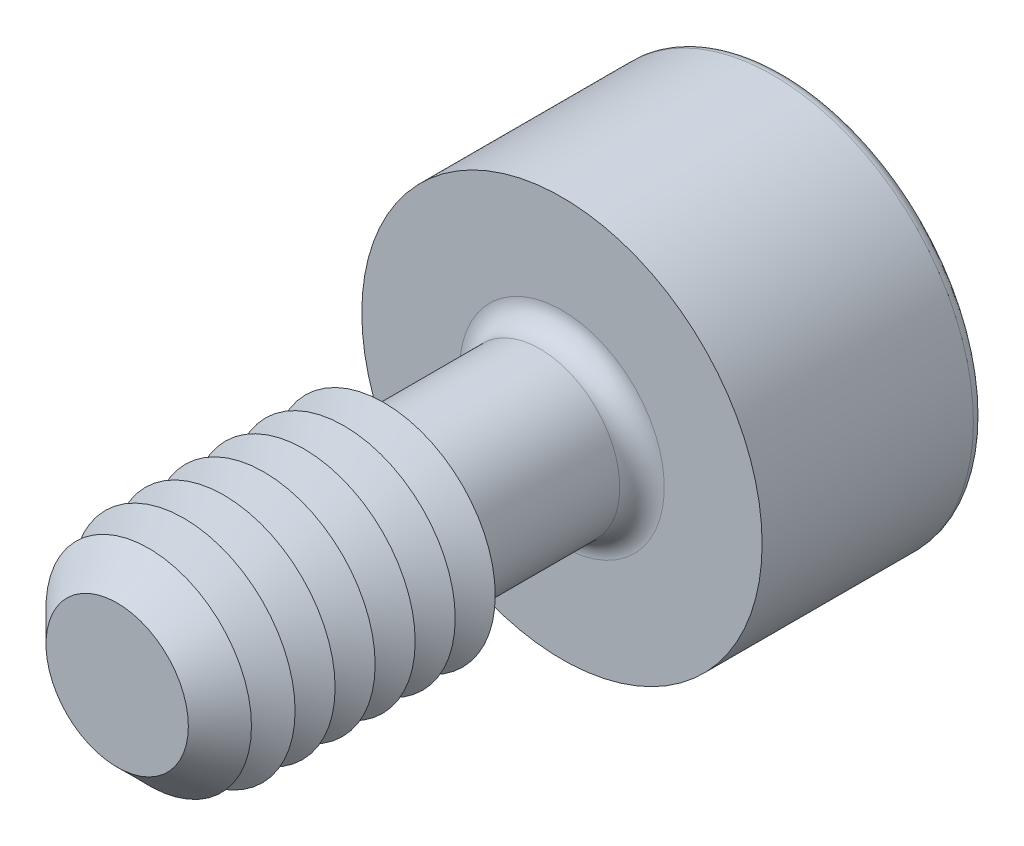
ISO-10303-21;
HEADER;
FILE_DESCRIPTION(('STEP AP214'),'2;1');
FILE_NAME('part.step','',(''),(''),'','','');
FILE_SCHEMA(('AUTOMOTIVE_DESIGN { 1 0 10303 214 1 1 1 1 }'));
ENDSEC;
DATA;
#1=APPLICATION_CONTEXT('core data for automotive mechanical design processes');
#2=APPLICATION_PROTOCOL_DEFINITION('international standard','automotive_design',2000,#1);
#3=PRODUCT_CONTEXT('',#1,'mechanical');
#4=PRODUCT('Part','Part','',(#3));
#5=PRODUCT_RELATED_PRODUCT_CATEGORY('part','',(#4));
#6=PRODUCT_DEFINITION_FORMATION('','',#4);
#7=PRODUCT_DEFINITION_CONTEXT('part definition',#1,'design');
#8=PRODUCT_DEFINITION('design','',#6,#7);
#9=PRODUCT_DEFINITION_SHAPE('','',#8);
#10=(LENGTH_UNIT() NAMED_UNIT(*) SI_UNIT(.MILLI.,.METRE.));
#11=(NAMED_UNIT(*) PLANE_ANGLE_UNIT() SI_UNIT($,.RADIAN.));
#12=(NAMED_UNIT(*) SI_UNIT($,.STERADIAN.) SOLID_ANGLE_UNIT());
#13=UNCERTAINTY_MEASURE_WITH_UNIT(LENGTH_MEASURE(1.E-05),#10,'distance_accuracy_value','');
#14=(GEOMETRIC_REPRESENTATION_CONTEXT(3) GLOBAL_UNCERTAINTY_ASSIGNED_CONTEXT((#13)) GLOBAL_UNIT_ASSIGNED_CONTEXT((#10,
#11,#12)) REPRESENTATION_CONTEXT('',''));
#15=CARTESIAN_POINT('',(0.,0.,0.));
#16=DIRECTION('',(0.,0.,1.));
#17=DIRECTION('',(1.,0.,0.));
#18=AXIS2_PLACEMENT_3D('',#15,#16,#17);
#19=CARTESIAN_POINT('',(-0.577350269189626,-0.999999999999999,-3.));
#20=DIRECTION('',(0.,0.,1.));
#21=DIRECTION('',(1.,0.,0.));
#22=AXIS2_PLACEMENT_3D('',#19,#20,#21);
#23=PLANE('',#22);
#24=DIRECTION('',(1.,0.,0.));
#25=VECTOR('',#24,1.);
#26=CARTESIAN_POINT('',(-0.577350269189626,-0.999999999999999,-3.));
#27=LINE('',#26,#25);
#28=CARTESIAN_POINT('',(0.,-0.999999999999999,-3.));
#29=VERTEX_POINT('',#28);
#30=CARTESIAN_POINT('',(0.577350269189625,-0.999999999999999,-3.));
#31=VERTEX_POINT('',#30);
#32=EDGE_CURVE('E694',#29,#31,#27,.T.);
#33=ORIENTED_EDGE('',*,*,#32,.F.);
#34=CARTESIAN_POINT('',(0.,0.,-3.));
#35=DIRECTION('',(0.,0.,1.));
#36=DIRECTION('',(0.,-1.,0.));
#37=AXIS2_PLACEMENT_3D('',#34,#35,#36);
#38=CIRCLE('',#37,1.);
#39=CARTESIAN_POINT('',(0.866025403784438,-0.499999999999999,-3.));
#40=VERTEX_POINT('',#39);
#41=EDGE_CURVE('E53',#29,#40,#38,.T.);
#42=ORIENTED_EDGE('',*,*,#41,.T.);
#43=DIRECTION('',(0.5,0.866025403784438,0.));
#44=VECTOR('',#43,1.);
#45=CARTESIAN_POINT('',(0.577350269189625,-0.999999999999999,-3.));
#46=LINE('',#45,#44);
#47=EDGE_CURVE('E680',#31,#40,#46,.T.);
#48=ORIENTED_EDGE('',*,*,#47,.F.);
#49=EDGE_LOOP('',(#33,#42,#48));
#50=FACE_BOUND('',#49,.T.);
#51=ADVANCED_FACE('F41',(#50),#23,.F.);
#52=CARTESIAN_POINT('',(1.15470053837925,0.,-3.));
#53=VERTEX_POINT('',#52);
#54=EDGE_CURVE('E690',#40,#53,#46,.T.);
#55=ORIENTED_EDGE('',*,*,#54,.F.);
#56=CARTESIAN_POINT('',(0.866025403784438,0.500000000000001,-3.));
#57=VERTEX_POINT('',#56);
#58=EDGE_CURVE('E11',#40,#57,#38,.T.);
#59=ORIENTED_EDGE('',*,*,#58,.T.);
#60=DIRECTION('',(-0.5,0.866025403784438,0.));
#61=VECTOR('',#60,1.);
#62=CARTESIAN_POINT('',(1.15470053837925,0.,-3.));
#63=LINE('',#62,#61);
#64=EDGE_CURVE('E679',#53,#57,#63,.T.);
#65=ORIENTED_EDGE('',*,*,#64,.F.);
#66=EDGE_LOOP('',(#55,#59,#65));
#67=FACE_BOUND('',#66,.T.);
#68=ADVANCED_FACE('F133',(#67),#23,.F.);
#69=CARTESIAN_POINT('',(0.577350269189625,1.,-3.));
#70=VERTEX_POINT('',#69);
#71=EDGE_CURVE('E674',#57,#70,#63,.T.);
#72=ORIENTED_EDGE('',*,*,#71,.F.);
#73=CARTESIAN_POINT('',(0.,1.,-3.));
#74=VERTEX_POINT('',#73);
#75=EDGE_CURVE('E51',#57,#74,#38,.T.);
#76=ORIENTED_EDGE('',*,*,#75,.T.);
#77=DIRECTION('',(-1.,0.,0.));
#78=VECTOR('',#77,1.);
#79=CARTESIAN_POINT('',(0.577350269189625,1.,-3.));
#80=LINE('',#79,#78);
#81=EDGE_CURVE('E177',#70,#74,#80,.T.);
#82=ORIENTED_EDGE('',*,*,#81,.F.);
#83=EDGE_LOOP('',(#72,#76,#82));
#84=FACE_BOUND('',#83,.T.);
#85=ADVANCED_FACE('F139',(#84),#23,.F.);
#86=CARTESIAN_POINT('',(-0.577350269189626,1.,-3.));
#87=VERTEX_POINT('',#86);
#88=EDGE_CURVE('E684',#74,#87,#80,.T.);
#89=ORIENTED_EDGE('',*,*,#88,.F.);
#90=CARTESIAN_POINT('',(-0.866025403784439,0.500000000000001,-3.));
#91=VERTEX_POINT('',#90);
#92=EDGE_CURVE('E263',#74,#91,#38,.T.);
#93=ORIENTED_EDGE('',*,*,#92,.T.);
#94=DIRECTION('',(-0.5,-0.866025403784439,0.));
#95=VECTOR('',#94,1.);
#96=CARTESIAN_POINT('',(-0.577350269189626,1.,-3.));
#97=LINE('',#96,#95);
#98=EDGE_CURVE('E176',#87,#91,#97,.T.);
#99=ORIENTED_EDGE('',*,*,#98,.F.);
#100=EDGE_LOOP('',(#89,#93,#99));
#101=FACE_BOUND('',#100,.T.);
#102=ADVANCED_FACE('F157',(#101),#23,.F.);
#103=CARTESIAN_POINT('',(-1.15470053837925,0.,-3.));
#104=VERTEX_POINT('',#103);
#105=EDGE_CURVE('E170',#91,#104,#97,.T.);
#106=ORIENTED_EDGE('',*,*,#105,.F.);
#107=CARTESIAN_POINT('',(-0.866025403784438,-0.5,-3.));
#108=VERTEX_POINT('',#107);
#109=EDGE_CURVE('E172',#91,#108,#38,.T.);
#110=ORIENTED_EDGE('',*,*,#109,.T.);
#111=DIRECTION('',(0.500000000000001,-0.866025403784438,0.));
#112=VECTOR('',#111,1.);
#113=CARTESIAN_POINT('',(-1.15470053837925,0.,-3.));
#114=LINE('',#113,#112);
#115=EDGE_CURVE('E174',#104,#108,#114,.T.);
#116=ORIENTED_EDGE('',*,*,#115,.F.);
#117=EDGE_LOOP('',(#106,#110,#116));
#118=FACE_BOUND('',#117,.T.);
#119=ADVANCED_FACE('F146',(#118),#23,.F.);
#120=CARTESIAN_POINT('',(0.,0.,-5.));
#121=DIRECTION('',(0.,0.,-1.));
#122=DIRECTION('',(-1.,0.,0.));
#123=AXIS2_PLACEMENT_3D('',#120,#121,#122);
#124=PLANE('',#123);
#125=CARTESIAN_POINT('',(0.,0.,-5.));
#126=DIRECTION('',(0.,0.,-1.));
#127=DIRECTION('',(-1.,0.,0.));
#128=AXIS2_PLACEMENT_3D('',#125,#126,#127);
#129=CIRCLE('',#128,2.125);
#130=CARTESIAN_POINT('',(-2.125,0.,-5.));
#131=VERTEX_POINT('',#130);
#132=EDGE_CURVE('E250',#131,#131,#129,.T.);
#133=ORIENTED_EDGE('',*,*,#132,.T.);
#134=EDGE_LOOP('',(#133));
#135=FACE_BOUND('',#134,.T.);
#136=DIRECTION('',(-0.5,-0.866025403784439,0.));
#137=VECTOR('',#136,1.);
#138=CARTESIAN_POINT('',(-0.577350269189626,1.,-5.));
#139=LINE('',#138,#137);
#140=CARTESIAN_POINT('',(-0.577350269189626,1.,-5.));
#141=VERTEX_POINT('',#140);
#142=CARTESIAN_POINT('',(-1.15470053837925,0.,-5.));
#143=VERTEX_POINT('',#142);
#144=EDGE_CURVE('E212',#141,#143,#139,.T.);
#145=ORIENTED_EDGE('',*,*,#144,.T.);
#146=DIRECTION('',(0.500000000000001,-0.866025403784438,0.));
#147=VECTOR('',#146,1.);
#148=CARTESIAN_POINT('',(-1.15470053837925,0.,-5.));
#149=LINE('',#148,#147);
#150=CARTESIAN_POINT('',(-0.577350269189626,-0.999999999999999,-5.));
#151=VERTEX_POINT('',#150);
#152=EDGE_CURVE('E67',#143,#151,#149,.T.);
#153=ORIENTED_EDGE('',*,*,#152,.T.);
#154=DIRECTION('',(1.,0.,0.));
#155=VECTOR('',#154,1.);
#156=CARTESIAN_POINT('',(-0.577350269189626,-0.999999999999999,-5.));
#157=LINE('',#156,#155);
#158=CARTESIAN_POINT('',(0.577350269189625,-0.999999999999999,-5.));
#159=VERTEX_POINT('',#158);
#160=EDGE_CURVE('E196',#151,#159,#157,.T.);
#161=ORIENTED_EDGE('',*,*,#160,.T.);
#162=DIRECTION('',(0.5,0.866025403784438,0.));
#163=VECTOR('',#162,1.);
#164=CARTESIAN_POINT('',(0.577350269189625,-0.999999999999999,-5.));
#165=LINE('',#164,#163);
#166=CARTESIAN_POINT('',(1.15470053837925,0.,-5.));
#167=VERTEX_POINT('',#166);
#168=EDGE_CURVE('E200',#159,#167,#165,.T.);
#169=ORIENTED_EDGE('',*,*,#168,.T.);
#170=DIRECTION('',(-0.5,0.866025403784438,0.));
#171=VECTOR('',#170,1.);
#172=CARTESIAN_POINT('',(1.15470053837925,0.,-5.));
#173=LINE('',#172,#171);
#174=CARTESIAN_POINT('',(0.577350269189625,1.,-5.));
#175=VERTEX_POINT('',#174);
#176=EDGE_CURVE('E204',#167,#175,#173,.T.);
#177=ORIENTED_EDGE('',*,*,#176,.T.);
#178=DIRECTION('',(-1.,0.,0.));
#179=VECTOR('',#178,1.);
#180=CARTESIAN_POINT('',(0.577350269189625,1.,-5.));
#181=LINE('',#180,#179);
#182=EDGE_CURVE('E208',#175,#141,#181,.T.);
#183=ORIENTED_EDGE('',*,*,#182,.T.);
#184=EDGE_LOOP('',(#145,#153,#161,#169,#177,#183));
#185=FACE_BOUND('',#184,.T.);
#186=ADVANCED_FACE('F156',(#135,#185),#124,.T.);
#187=CARTESIAN_POINT('',(0.,0.,2.5));
#188=DIRECTION('',(0.,0.,-1.));
#189=DIRECTION('',(-1.,0.,0.));
#190=AXIS2_PLACEMENT_3D('',#187,#188,#189);
#191=CYLINDRICAL_SURFACE('',#190,0.9);
#192=CARTESIAN_POINT('',(0.,0.,-2.25));
#193=DIRECTION('',(0.,0.,-1.));
#194=DIRECTION('',(-1.,0.,0.));
#195=AXIS2_PLACEMENT_3D('',#192,#193,#194);
#196=CIRCLE('',#195,0.9);
#197=CARTESIAN_POINT('',(-0.9,0.,-2.25));
#198=VERTEX_POINT('',#197);
#199=EDGE_CURVE('E246',#198,#198,#196,.F.);
#200=ORIENTED_EDGE('',*,*,#199,.T.);
#201=EDGE_LOOP('',(#200));
#202=FACE_BOUND('',#201,.T.);
#203=CARTESIAN_POINT('',(0.,0.,-0.702072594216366));
#204=DIRECTION('',(0.,0.,-1.));
#205=DIRECTION('',(0.,1.,0.));
#206=AXIS2_PLACEMENT_3D('',#203,#204,#205);
#207=CIRCLE('',#206,0.9);
#208=CARTESIAN_POINT('',(0.,0.9,-0.702072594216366));
#209=VERTEX_POINT('',#208);
#210=EDGE_CURVE('E235',#209,#209,#207,.T.);
#211=ORIENTED_EDGE('',*,*,#210,.T.);
#212=EDGE_LOOP('',(#211));
#213=FACE_BOUND('',#212,.T.);
#214=ADVANCED_FACE('F163',(#202,#213),#191,.T.);
#215=CARTESIAN_POINT('',(0.,0.,-0.702072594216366));
#216=DIRECTION('',(0.,0.,1.));
#217=DIRECTION('',(0.,-1.,0.));
#218=AXIS2_PLACEMENT_3D('',#215,#216,#217);
#219=CONICAL_SURFACE('',#218,0.9,1.0471975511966);
#220=CARTESIAN_POINT('',(0.,0.,-0.5));
#221=DIRECTION('',(0.,0.,-1.));
#222=DIRECTION('',(-1.,0.,0.));
#223=AXIS2_PLACEMENT_3D('',#220,#221,#222);
#224=CIRCLE('',#223,1.25);
#225=CARTESIAN_POINT('',(-1.25,0.,-0.5));
#226=VERTEX_POINT('',#225);
#227=EDGE_CURVE('E267',#226,#226,#224,.T.);
#228=ORIENTED_EDGE('',*,*,#227,.T.);
#229=EDGE_LOOP('',(#228));
#230=FACE_BOUND('',#229,.T.);
#231=ORIENTED_EDGE('',*,*,#210,.F.);
#232=EDGE_LOOP('',(#231));
#233=FACE_BOUND('',#232,.T.);
#234=ADVANCED_FACE('F459',(#230,#233),#219,.T.);
#235=CARTESIAN_POINT('',(0.,0.,-2.5));
#236=DIRECTION('',(0.,0.,-1.));
#237=DIRECTION('',(-1.,0.,0.));
#238=AXIS2_PLACEMENT_3D('',#235,#236,#237);
#239=PLANE('',#238);
#240=CARTESIAN_POINT('',(0.,0.,-2.5));
#241=DIRECTION('',(0.,0.,-1.));
#242=DIRECTION('',(-1.,0.,0.));
#243=AXIS2_PLACEMENT_3D('',#240,#241,#242);
#244=CIRCLE('',#243,1.15);
#245=CARTESIAN_POINT('',(-1.15,0.,-2.5));
#246=VERTEX_POINT('',#245);
#247=EDGE_CURVE('E243',#246,#246,#244,.T.);
#248=ORIENTED_EDGE('',*,*,#247,.T.);
#249=EDGE_LOOP('',(#248));
#250=FACE_BOUND('',#249,.T.);
#251=CARTESIAN_POINT('',(0.,0.,-2.5));
#252=DIRECTION('',(0.,0.,-1.));
#253=DIRECTION('',(-1.,0.,0.));
#254=AXIS2_PLACEMENT_3D('',#251,#252,#253);
#255=CIRCLE('',#254,2.25);
#256=CARTESIAN_POINT('',(-2.25,0.,-2.5));
#257=VERTEX_POINT('',#256);
#258=EDGE_CURVE('E231',#257,#257,#255,.T.);
#259=ORIENTED_EDGE('',*,*,#258,.F.);
#260=EDGE_LOOP('',(#259));
#261=FACE_BOUND('',#260,.T.);
#262=ADVANCED_FACE('F452',(#250,#261),#239,.F.);
#263=CARTESIAN_POINT('',(0.,0.,-5.));
#264=DIRECTION('',(0.,0.,1.));
#265=DIRECTION('',(1.,0.,0.));
#266=AXIS2_PLACEMENT_3D('',#263,#264,#265);
#267=CYLINDRICAL_SURFACE('',#266,2.25);
#268=CARTESIAN_POINT('',(0.,0.,-4.875));
#269=DIRECTION('',(0.,0.,-1.));
#270=DIRECTION('',(-1.,0.,0.));
#271=AXIS2_PLACEMENT_3D('',#268,#269,#270);
#272=CIRCLE('',#271,2.25);
#273=CARTESIAN_POINT('',(-2.25,0.,-4.875));
#274=VERTEX_POINT('',#273);
#275=EDGE_CURVE('E253',#274,#274,#272,.F.);
#276=ORIENTED_EDGE('',*,*,#275,.T.);
#277=EDGE_LOOP('',(#276));
#278=FACE_BOUND('',#277,.T.);
#279=ORIENTED_EDGE('',*,*,#258,.T.);
#280=EDGE_LOOP('',(#279));
#281=FACE_BOUND('',#280,.T.);
#282=ADVANCED_FACE('F458',(#278,#281),#267,.T.);
#283=CARTESIAN_POINT('',(-1.15470053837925,0.,-3.));
#284=DIRECTION('',(0.866025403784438,0.500000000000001,0.));
#285=DIRECTION('',(-0.500000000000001,0.866025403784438,0.));
#286=AXIS2_PLACEMENT_3D('',#283,#284,#285);
#287=PLANE('',#286);
#288=ORIENTED_EDGE('',*,*,#152,.F.);
#289=DIRECTION('',(0.,0.,-1.));
#290=VECTOR('',#289,1.);
#291=CARTESIAN_POINT('',(-1.15470053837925,0.,-3.));
#292=LINE('',#291,#290);
#293=EDGE_CURVE('E186',#104,#143,#292,.T.);
#294=ORIENTED_EDGE('',*,*,#293,.F.);
#295=ORIENTED_EDGE('',*,*,#115,.T.);
#296=CARTESIAN_POINT('',(-0.577350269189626,-0.999999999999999,-3.));
#297=VERTEX_POINT('',#296);
#298=EDGE_CURVE('E215',#108,#297,#114,.T.);
#299=ORIENTED_EDGE('',*,*,#298,.T.);
#300=DIRECTION('',(0.,0.,-1.));
#301=VECTOR('',#300,1.);
#302=CARTESIAN_POINT('',(-0.577350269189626,-0.999999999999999,-3.));
#303=LINE('',#302,#301);
#304=EDGE_CURVE('E228',#297,#151,#303,.T.);
#305=ORIENTED_EDGE('',*,*,#304,.T.);
#306=EDGE_LOOP('',(#288,#294,#295,#299,#305));
#307=FACE_BOUND('',#306,.T.);
#308=ADVANCED_FACE('F470',(#307),#287,.T.);
#309=CARTESIAN_POINT('',(-0.577350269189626,-0.999999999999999,-3.));
#310=DIRECTION('',(0.,1.,0.));
#311=DIRECTION('',(-1.,0.,0.));
#312=AXIS2_PLACEMENT_3D('',#309,#310,#311);
#313=PLANE('',#312);
#314=ORIENTED_EDGE('',*,*,#160,.F.);
#315=ORIENTED_EDGE('',*,*,#304,.F.);
#316=EDGE_CURVE('E691',#297,#29,#27,.T.);
#317=ORIENTED_EDGE('',*,*,#316,.T.);
#318=ORIENTED_EDGE('',*,*,#32,.T.);
#319=DIRECTION('',(0.,0.,-1.));
#320=VECTOR('',#319,1.);
#321=CARTESIAN_POINT('',(0.577350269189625,-0.999999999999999,-3.));
#322=LINE('',#321,#320);
#323=EDGE_CURVE('E225',#31,#159,#322,.T.);
#324=ORIENTED_EDGE('',*,*,#323,.T.);
#325=EDGE_LOOP('',(#314,#315,#317,#318,#324));
#326=FACE_BOUND('',#325,.T.);
#327=ADVANCED_FACE('F486',(#326),#313,.T.);
#328=CARTESIAN_POINT('',(0.577350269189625,-0.999999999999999,-3.));
#329=DIRECTION('',(-0.866025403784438,0.5,0.));
#330=DIRECTION('',(-0.5,-0.866025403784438,0.));
#331=AXIS2_PLACEMENT_3D('',#328,#329,#330);
#332=PLANE('',#331);
#333=ORIENTED_EDGE('',*,*,#168,.F.);
#334=ORIENTED_EDGE('',*,*,#323,.F.);
#335=ORIENTED_EDGE('',*,*,#47,.T.);
#336=ORIENTED_EDGE('',*,*,#54,.T.);
#337=DIRECTION('',(0.,0.,-1.));
#338=VECTOR('',#337,1.);
#339=CARTESIAN_POINT('',(1.15470053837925,0.,-3.));
#340=LINE('',#339,#338);
#341=EDGE_CURVE('E222',#53,#167,#340,.T.);
#342=ORIENTED_EDGE('',*,*,#341,.T.);
#343=EDGE_LOOP('',(#333,#334,#335,#336,#342));
#344=FACE_BOUND('',#343,.T.);
#345=ADVANCED_FACE('F496',(#344),#332,.T.);
#346=CARTESIAN_POINT('',(1.15470053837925,0.,-3.));
#347=DIRECTION('',(-0.866025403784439,-0.5,0.));
#348=DIRECTION('',(0.5,-0.866025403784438,0.));
#349=AXIS2_PLACEMENT_3D('',#346,#347,#348);
#350=PLANE('',#349);
#351=ORIENTED_EDGE('',*,*,#176,.F.);
#352=ORIENTED_EDGE('',*,*,#341,.F.);
#353=ORIENTED_EDGE('',*,*,#64,.T.);
#354=ORIENTED_EDGE('',*,*,#71,.T.);
#355=DIRECTION('',(0.,0.,-1.));
#356=VECTOR('',#355,1.);
#357=CARTESIAN_POINT('',(0.577350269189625,1.,-3.));
#358=LINE('',#357,#356);
#359=EDGE_CURVE('E219',#70,#175,#358,.T.);
#360=ORIENTED_EDGE('',*,*,#359,.T.);
#361=EDGE_LOOP('',(#351,#352,#353,#354,#360));
#362=FACE_BOUND('',#361,.T.);
#363=ADVANCED_FACE('F506',(#362),#350,.T.);
#364=CARTESIAN_POINT('',(0.577350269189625,1.,-3.));
#365=DIRECTION('',(0.,-1.,0.));
#366=DIRECTION('',(1.,0.,0.));
#367=AXIS2_PLACEMENT_3D('',#364,#365,#366);
#368=PLANE('',#367);
#369=ORIENTED_EDGE('',*,*,#182,.F.);
#370=ORIENTED_EDGE('',*,*,#359,.F.);
#371=ORIENTED_EDGE('',*,*,#81,.T.);
#372=ORIENTED_EDGE('',*,*,#88,.T.);
#373=DIRECTION('',(0.,0.,-1.));
#374=VECTOR('',#373,1.);
#375=CARTESIAN_POINT('',(-0.577350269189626,1.,-3.));
#376=LINE('',#375,#374);
#377=EDGE_CURVE('E182',#87,#141,#376,.T.);
#378=ORIENTED_EDGE('',*,*,#377,.T.);
#379=EDGE_LOOP('',(#369,#370,#371,#372,#378));
#380=FACE_BOUND('',#379,.T.);
#381=ADVANCED_FACE('F152',(#380),#368,.T.);
#382=CARTESIAN_POINT('',(-0.577350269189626,1.,-3.));
#383=DIRECTION('',(0.866025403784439,-0.5,0.));
#384=DIRECTION('',(0.5,0.866025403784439,0.));
#385=AXIS2_PLACEMENT_3D('',#382,#383,#384);
#386=PLANE('',#385);
#387=ORIENTED_EDGE('',*,*,#144,.F.);
#388=ORIENTED_EDGE('',*,*,#377,.F.);
#389=ORIENTED_EDGE('',*,*,#98,.T.);
#390=ORIENTED_EDGE('',*,*,#105,.T.);
#391=ORIENTED_EDGE('',*,*,#293,.T.);
#392=EDGE_LOOP('',(#387,#388,#389,#390,#391));
#393=FACE_BOUND('',#392,.T.);
#394=ADVANCED_FACE('F144',(#393),#386,.T.);
#395=ORIENTED_EDGE('',*,*,#298,.F.);
#396=EDGE_CURVE('E256',#108,#29,#38,.T.);
#397=ORIENTED_EDGE('',*,*,#396,.T.);
#398=ORIENTED_EDGE('',*,*,#316,.F.);
#399=EDGE_LOOP('',(#395,#397,#398));
#400=FACE_BOUND('',#399,.T.);
#401=ADVANCED_FACE('F135',(#400),#23,.F.);
#402=CARTESIAN_POINT('',(0.,0.,-2.25));
#403=DIRECTION('',(0.,0.,-1.));
#404=DIRECTION('',(-1.,0.,0.));
#405=AXIS2_PLACEMENT_3D('',#402,#403,#404);
#406=TOROIDAL_SURFACE('',#405,1.15,0.25);
#407=ORIENTED_EDGE('',*,*,#199,.F.);
#408=EDGE_LOOP('',(#407));
#409=FACE_BOUND('',#408,.T.);
#410=ORIENTED_EDGE('',*,*,#247,.F.);
#411=EDGE_LOOP('',(#410));
#412=FACE_BOUND('',#411,.T.);
#413=ADVANCED_FACE('F129',(#409,#412),#406,.F.);
#414=CARTESIAN_POINT('',(0.,0.,-4.875));
#415=DIRECTION('',(0.,0.,-1.));
#416=DIRECTION('',(-1.,0.,0.));
#417=AXIS2_PLACEMENT_3D('',#414,#415,#416);
#418=TOROIDAL_SURFACE('',#417,2.125,0.125);
#419=ORIENTED_EDGE('',*,*,#275,.F.);
#420=EDGE_LOOP('',(#419));
#421=FACE_BOUND('',#420,.T.);
#422=ORIENTED_EDGE('',*,*,#132,.F.);
#423=EDGE_LOOP('',(#422));
#424=FACE_BOUND('',#423,.T.);
#425=ADVANCED_FACE('F43',(#421,#424),#418,.T.);
#426=CARTESIAN_POINT('',(0.,0.,-2.42264973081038));
#427=DIRECTION('',(0.,0.,-1.));
#428=DIRECTION('',(0.,1.,0.));
#429=AXIS2_PLACEMENT_3D('',#426,#427,#428);
#430=CONICAL_SURFACE('',#429,0.,1.0471975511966);
#431=ORIENTED_EDGE('',*,*,#41,.F.);
#432=ORIENTED_EDGE('',*,*,#396,.F.);
#433=ORIENTED_EDGE('',*,*,#109,.F.);
#434=ORIENTED_EDGE('',*,*,#92,.F.);
#435=ORIENTED_EDGE('',*,*,#75,.F.);
#436=ORIENTED_EDGE('',*,*,#58,.F.);
#437=EDGE_LOOP('',(#431,#432,#433,#434,#435,#436));
#438=FACE_BOUND('',#437,.T.);
#439=CARTESIAN_POINT('',(0.,0.,-2.42264973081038));
#440=VERTEX_POINT('',#439);
#441=VERTEX_LOOP('',#440);
#442=FACE_BOUND('',#441,.T.);
#443=ADVANCED_FACE('F118',(#438,#442),#430,.F.);
#444=CARTESIAN_POINT('',(0.,0.,-0.274999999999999));
#445=DIRECTION('',(0.,0.,-1.));
#446=DIRECTION('',(-1.,0.,0.));
#447=AXIS2_PLACEMENT_3D('',#444,#445,#446);
#448=CONICAL_SURFACE('',#447,0.860288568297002,1.0471975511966);
#449=ORIENTED_EDGE('',*,*,#227,.F.);
#450=EDGE_LOOP('',(#449));
#451=FACE_BOUND('',#450,.T.);
#452=CARTESIAN_POINT('',(0.,0.,-0.274999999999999));
#453=DIRECTION('',(0.,0.,-1.));
#454=DIRECTION('',(-1.,0.,0.));
#455=AXIS2_PLACEMENT_3D('',#452,#453,#454);
#456=CIRCLE('',#455,0.860288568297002);
#457=CARTESIAN_POINT('',(-0.860288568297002,0.,-0.274999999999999));
#458=VERTEX_POINT('',#457);
#459=EDGE_CURVE('E273',#458,#458,#456,.T.);
#460=ORIENTED_EDGE('',*,*,#459,.T.);
#461=EDGE_LOOP('',(#460));
#462=FACE_BOUND('',#461,.T.);
#463=ADVANCED_FACE('F120',(#451,#462),#448,.T.);
#464=CARTESIAN_POINT('',(0.,0.,-0.0499999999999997));
#465=DIRECTION('',(0.,0.,1.));
#466=DIRECTION('',(1.,0.,0.));
#467=AXIS2_PLACEMENT_3D('',#464,#465,#466);
#468=CONICAL_SURFACE('',#467,1.25,1.0471975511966);
#469=ORIENTED_EDGE('',*,*,#459,.F.);
#470=EDGE_LOOP('',(#469));
#471=FACE_BOUND('',#470,.T.);
#472=CARTESIAN_POINT('',(0.,0.,-0.0499999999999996));
#473=DIRECTION('',(0.,0.,-1.));
#474=DIRECTION('',(-1.,0.,0.));
#475=AXIS2_PLACEMENT_3D('',#472,#473,#474);
#476=CIRCLE('',#475,1.25);
#477=CARTESIAN_POINT('',(-1.25,0.,-0.0499999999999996));
#478=VERTEX_POINT('',#477);
#479=EDGE_CURVE('E280',#478,#478,#476,.T.);
#480=ORIENTED_EDGE('',*,*,#479,.T.);
#481=EDGE_LOOP('',(#480));
#482=FACE_BOUND('',#481,.T.);
#483=ADVANCED_FACE('F126',(#471,#482),#468,.T.);
#484=CARTESIAN_POINT('',(0.,0.,0.175000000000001));
#485=DIRECTION('',(0.,0.,-1.));
#486=DIRECTION('',(-1.,0.,0.));
#487=AXIS2_PLACEMENT_3D('',#484,#485,#486);
#488=CONICAL_SURFACE('',#487,0.860288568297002,1.0471975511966);
#489=ORIENTED_EDGE('',*,*,#479,.F.);
#490=EDGE_LOOP('',(#489));
#491=FACE_BOUND('',#490,.T.);
#492=CARTESIAN_POINT('',(0.,0.,0.175000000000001));
#493=DIRECTION('',(0.,0.,-1.));
#494=DIRECTION('',(-1.,0.,0.));
#495=AXIS2_PLACEMENT_3D('',#492,#493,#494);
#496=CIRCLE('',#495,0.860288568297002);
#497=CARTESIAN_POINT('',(-0.860288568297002,0.,0.175000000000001));
#498=VERTEX_POINT('',#497);
#499=EDGE_CURVE('E285',#498,#498,#496,.T.);
#500=ORIENTED_EDGE('',*,*,#499,.T.);
#501=EDGE_LOOP('',(#500));
#502=FACE_BOUND('',#501,.T.);
#503=ADVANCED_FACE('F366',(#491,#502),#488,.T.);
#504=CARTESIAN_POINT('',(0.,0.,0.4));
#505=DIRECTION('',(0.,0.,1.));
#506=DIRECTION('',(1.,0.,0.));
#507=AXIS2_PLACEMENT_3D('',#504,#505,#506);
#508=CONICAL_SURFACE('',#507,1.25,1.0471975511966);
#509=ORIENTED_EDGE('',*,*,#499,.F.);
#510=EDGE_LOOP('',(#509));
#511=FACE_BOUND('',#510,.T.);
#512=CARTESIAN_POINT('',(0.,0.,0.4));
#513=DIRECTION('',(0.,0.,-1.));
#514=DIRECTION('',(-1.,0.,0.));
#515=AXIS2_PLACEMENT_3D('',#512,#513,#514);
#516=CIRCLE('',#515,1.25);
#517=CARTESIAN_POINT('',(-1.25,0.,0.4));
#518=VERTEX_POINT('',#517);
#519=EDGE_CURVE('E289',#518,#518,#516,.T.);
#520=ORIENTED_EDGE('',*,*,#519,.T.);
#521=EDGE_LOOP('',(#520));
#522=FACE_BOUND('',#521,.T.);
#523=ADVANCED_FACE('F362',(#511,#522),#508,.T.);
#524=CARTESIAN_POINT('',(0.,0.,0.625000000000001));
#525=DIRECTION('',(0.,0.,-1.));
#526=DIRECTION('',(-1.,0.,0.));
#527=AXIS2_PLACEMENT_3D('',#524,#525,#526);
#528=CONICAL_SURFACE('',#527,0.860288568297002,1.0471975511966);
#529=ORIENTED_EDGE('',*,*,#519,.F.);
#530=EDGE_LOOP('',(#529));
#531=FACE_BOUND('',#530,.T.);
#532=CARTESIAN_POINT('',(0.,0.,0.625000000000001));
#533=DIRECTION('',(0.,0.,-1.));
#534=DIRECTION('',(-1.,0.,0.));
#535=AXIS2_PLACEMENT_3D('',#532,#533,#534);
#536=CIRCLE('',#535,0.860288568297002);
#537=CARTESIAN_POINT('',(-0.860288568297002,0.,0.625000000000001));
#538=VERTEX_POINT('',#537);
#539=EDGE_CURVE('E293',#538,#538,#536,.T.);
#540=ORIENTED_EDGE('',*,*,#539,.T.);
#541=EDGE_LOOP('',(#540));
#542=FACE_BOUND('',#541,.T.);
#543=ADVANCED_FACE('F358',(#531,#542),#528,.T.);
#544=CARTESIAN_POINT('',(0.,0.,0.85));
#545=DIRECTION('',(0.,0.,1.));
#546=DIRECTION('',(1.,0.,0.));
#547=AXIS2_PLACEMENT_3D('',#544,#545,#546);
#548=CONICAL_SURFACE('',#547,1.25,1.0471975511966);
#549=ORIENTED_EDGE('',*,*,#539,.F.);
#550=EDGE_LOOP('',(#549));
#551=FACE_BOUND('',#550,.T.);
#552=CARTESIAN_POINT('',(0.,0.,0.850000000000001));
#553=DIRECTION('',(0.,0.,-1.));
#554=DIRECTION('',(-1.,0.,0.));
#555=AXIS2_PLACEMENT_3D('',#552,#553,#554);
#556=CIRCLE('',#555,1.25);
#557=CARTESIAN_POINT('',(-1.25,0.,0.850000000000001));
#558=VERTEX_POINT('',#557);
#559=EDGE_CURVE('E297',#558,#558,#556,.T.);
#560=ORIENTED_EDGE('',*,*,#559,.T.);
#561=EDGE_LOOP('',(#560));
#562=FACE_BOUND('',#561,.T.);
#563=ADVANCED_FACE('F354',(#551,#562),#548,.T.);
#564=CARTESIAN_POINT('',(0.,0.,1.075));
#565=DIRECTION('',(0.,0.,-1.));
#566=DIRECTION('',(-1.,0.,0.));
#567=AXIS2_PLACEMENT_3D('',#564,#565,#566);
#568=CONICAL_SURFACE('',#567,0.860288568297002,1.0471975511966);
#569=ORIENTED_EDGE('',*,*,#559,.F.);
#570=EDGE_LOOP('',(#569));
#571=FACE_BOUND('',#570,.T.);
#572=CARTESIAN_POINT('',(0.,0.,1.075));
#573=DIRECTION('',(0.,0.,-1.));
#574=DIRECTION('',(-1.,0.,0.));
#575=AXIS2_PLACEMENT_3D('',#572,#573,#574);
#576=CIRCLE('',#575,0.860288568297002);
#577=CARTESIAN_POINT('',(-0.860288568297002,0.,1.075));
#578=VERTEX_POINT('',#577);
#579=EDGE_CURVE('E301',#578,#578,#576,.T.);
#580=ORIENTED_EDGE('',*,*,#579,.T.);
#581=EDGE_LOOP('',(#580));
#582=FACE_BOUND('',#581,.T.);
#583=ADVANCED_FACE('F350',(#571,#582),#568,.T.);
#584=CARTESIAN_POINT('',(0.,0.,1.3));
#585=DIRECTION('',(0.,0.,1.));
#586=DIRECTION('',(1.,0.,0.));
#587=AXIS2_PLACEMENT_3D('',#584,#585,#586);
#588=CONICAL_SURFACE('',#587,1.25,1.0471975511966);
#589=ORIENTED_EDGE('',*,*,#579,.F.);
#590=EDGE_LOOP('',(#589));
#591=FACE_BOUND('',#590,.T.);
#592=CARTESIAN_POINT('',(0.,0.,1.3));
#593=DIRECTION('',(0.,0.,-1.));
#594=DIRECTION('',(-1.,0.,0.));
#595=AXIS2_PLACEMENT_3D('',#592,#593,#594);
#596=CIRCLE('',#595,1.25);
#597=CARTESIAN_POINT('',(-1.25,0.,1.3));
#598=VERTEX_POINT('',#597);
#599=EDGE_CURVE('E305',#598,#598,#596,.T.);
#600=ORIENTED_EDGE('',*,*,#599,.T.);
#601=EDGE_LOOP('',(#600));
#602=FACE_BOUND('',#601,.T.);
#603=ADVANCED_FACE('F346',(#591,#602),#588,.T.);
#604=CARTESIAN_POINT('',(0.,0.,1.525));
#605=DIRECTION('',(0.,0.,-1.));
#606=DIRECTION('',(-1.,0.,0.));
#607=AXIS2_PLACEMENT_3D('',#604,#605,#606);
#608=CONICAL_SURFACE('',#607,0.860288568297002,1.0471975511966);
#609=ORIENTED_EDGE('',*,*,#599,.F.);
#610=EDGE_LOOP('',(#609));
#611=FACE_BOUND('',#610,.T.);
#612=CARTESIAN_POINT('',(0.,0.,1.525));
#613=DIRECTION('',(0.,0.,-1.));
#614=DIRECTION('',(-1.,0.,0.));
#615=AXIS2_PLACEMENT_3D('',#612,#613,#614);
#616=CIRCLE('',#615,0.860288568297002);
#617=CARTESIAN_POINT('',(-0.860288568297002,0.,1.525));
#618=VERTEX_POINT('',#617);
#619=EDGE_CURVE('E309',#618,#618,#616,.T.);
#620=ORIENTED_EDGE('',*,*,#619,.T.);
#621=EDGE_LOOP('',(#620));
#622=FACE_BOUND('',#621,.T.);
#623=ADVANCED_FACE('F342',(#611,#622),#608,.T.);
#624=CARTESIAN_POINT('',(0.,0.,1.75));
#625=DIRECTION('',(0.,0.,1.));
#626=DIRECTION('',(1.,0.,0.));
#627=AXIS2_PLACEMENT_3D('',#624,#625,#626);
#628=CONICAL_SURFACE('',#627,1.25,1.0471975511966);
#629=ORIENTED_EDGE('',*,*,#619,.F.);
#630=EDGE_LOOP('',(#629));
#631=FACE_BOUND('',#630,.T.);
#632=CARTESIAN_POINT('',(0.,0.,1.75));
#633=DIRECTION('',(0.,0.,-1.));
#634=DIRECTION('',(-1.,0.,0.));
#635=AXIS2_PLACEMENT_3D('',#632,#633,#634);
#636=CIRCLE('',#635,1.25);
#637=CARTESIAN_POINT('',(-1.25,0.,1.75));
#638=VERTEX_POINT('',#637);
#639=EDGE_CURVE('E312',#638,#638,#636,.T.);
#640=ORIENTED_EDGE('',*,*,#639,.T.);
#641=EDGE_LOOP('',(#640));
#642=FACE_BOUND('',#641,.T.);
#643=ADVANCED_FACE('F335',(#631,#642),#628,.T.);
#644=CARTESIAN_POINT('',(0.,0.,1.975));
#645=DIRECTION('',(0.,0.,-1.));
#646=DIRECTION('',(-1.,0.,0.));
#647=AXIS2_PLACEMENT_3D('',#644,#645,#646);
#648=CONICAL_SURFACE('',#647,0.860288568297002,1.0471975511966);
#649=ORIENTED_EDGE('',*,*,#639,.F.);
#650=EDGE_LOOP('',(#649));
#651=FACE_BOUND('',#650,.T.);
#652=CARTESIAN_POINT('',(0.,0.,1.975));
#653=DIRECTION('',(0.,0.,-1.));
#654=DIRECTION('',(-1.,0.,0.));
#655=AXIS2_PLACEMENT_3D('',#652,#653,#654);
#656=CIRCLE('',#655,0.860288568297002);
#657=CARTESIAN_POINT('',(-0.860288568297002,0.,1.975));
#658=VERTEX_POINT('',#657);
#659=EDGE_CURVE('E316',#658,#658,#656,.T.);
#660=ORIENTED_EDGE('',*,*,#659,.T.);
#661=EDGE_LOOP('',(#660));
#662=FACE_BOUND('',#661,.T.);
#663=ADVANCED_FACE('F321',(#651,#662),#648,.T.);
#664=CARTESIAN_POINT('',(0.,0.,2.2));
#665=DIRECTION('',(0.,0.,1.));
#666=DIRECTION('',(1.,0.,0.));
#667=AXIS2_PLACEMENT_3D('',#664,#665,#666);
#668=CONICAL_SURFACE('',#667,1.25,1.0471975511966);
#669=CARTESIAN_POINT('',(0.,0.,2.14509618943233));
#670=DIRECTION('',(0.,0.,1.));
#671=DIRECTION('',(1.,0.,0.));
#672=AXIS2_PLACEMENT_3D('',#669,#670,#671);
#673=CIRCLE('',#672,1.15490381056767);
#674=CARTESIAN_POINT('',(1.15490381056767,0.,2.14509618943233));
#675=VERTEX_POINT('',#674);
#676=EDGE_CURVE('E45',#675,#675,#673,.F.);
#677=ORIENTED_EDGE('',*,*,#676,.T.);
#678=EDGE_LOOP('',(#677));
#679=FACE_BOUND('',#678,.T.);
#680=ORIENTED_EDGE('',*,*,#659,.F.);
#681=EDGE_LOOP('',(#680));
#682=FACE_BOUND('',#681,.T.);
#683=ADVANCED_FACE('F323',(#679,#682),#668,.T.);
#684=CARTESIAN_POINT('',(0.,0.,2.5));
#685=DIRECTION('',(0.,0.,1.));
#686=DIRECTION('',(1.,0.,0.));
#687=AXIS2_PLACEMENT_3D('',#684,#685,#686);
#688=PLANE('',#687);
#689=CARTESIAN_POINT('',(0.,0.,2.5));
#690=DIRECTION('',(0.,0.,1.));
#691=DIRECTION('',(1.,0.,0.));
#692=AXIS2_PLACEMENT_3D('',#689,#690,#691);
#693=CIRCLE('',#692,0.799999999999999);
#694=CARTESIAN_POINT('',(0.799999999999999,0.,2.5));
#695=VERTEX_POINT('',#694);
#696=EDGE_CURVE('E239',#695,#695,#693,.T.);
#697=ORIENTED_EDGE('',*,*,#696,.T.);
#698=EDGE_LOOP('',(#697));
#699=FACE_BOUND('',#698,.T.);
#700=ADVANCED_FACE('F325',(#699),#688,.T.);
#701=CARTESIAN_POINT('',(0.,0.,2.05));
#702=DIRECTION('',(0.,0.,-1.));
#703=DIRECTION('',(0.,1.,0.));
#704=AXIS2_PLACEMENT_3D('',#701,#702,#703);
#705=CONICAL_SURFACE('',#704,1.25,0.785398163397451);
#706=ORIENTED_EDGE('',*,*,#676,.F.);
#707=EDGE_LOOP('',(#706));
#708=FACE_BOUND('',#707,.T.);
#709=ORIENTED_EDGE('',*,*,#696,.F.);
#710=EDGE_LOOP('',(#709));
#711=FACE_BOUND('',#710,.T.);
#712=ADVANCED_FACE('F332',(#708,#711),#705,.T.);
#713=CLOSED_SHELL('',(#51,#68,#85,#102,#119,#186,#214,#234,#262,#282,#308,#327,#345,#363,#381,
#394,#401,#413,#425,#443,#463,#483,#503,#523,#543,#563,#583,#603,#623,#643,#663,#683,#700,#712));
#714=MANIFOLD_SOLID_BREP('B2',#713);
#715=ADVANCED_BREP_SHAPE_REPRESENTATION('',(#18,#714),#14);
#716=SHAPE_DEFINITION_REPRESENTATION(#9,#715);
ENDSEC;
END-ISO-10303-21;
